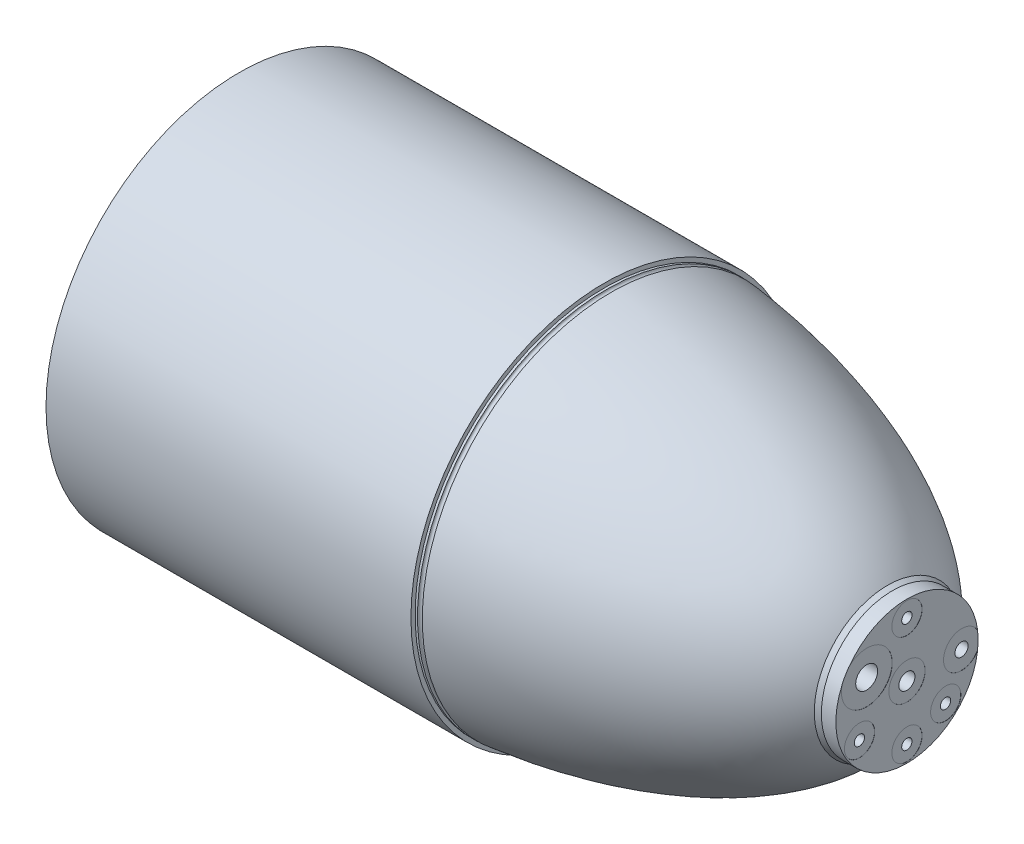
ISO-10303-21;
HEADER;
FILE_DESCRIPTION(('STEP AP214'),'2;1');
FILE_NAME('part.step','',(''),(''),'','','');
FILE_SCHEMA(('AUTOMOTIVE_DESIGN { 1 0 10303 214 1 1 1 1 }'));
ENDSEC;
DATA;
#1=APPLICATION_CONTEXT('core data for automotive mechanical design processes');
#2=APPLICATION_PROTOCOL_DEFINITION('international standard','automotive_design',2000,#1);
#3=PRODUCT_CONTEXT('',#1,'mechanical');
#4=PRODUCT('Part','Part','',(#3));
#5=PRODUCT_RELATED_PRODUCT_CATEGORY('part','',(#4));
#6=PRODUCT_DEFINITION_FORMATION('','',#4);
#7=PRODUCT_DEFINITION_CONTEXT('part definition',#1,'design');
#8=PRODUCT_DEFINITION('design','',#6,#7);
#9=PRODUCT_DEFINITION_SHAPE('','',#8);
#10=(LENGTH_UNIT() NAMED_UNIT(*) SI_UNIT(.MILLI.,.METRE.));
#11=(NAMED_UNIT(*) PLANE_ANGLE_UNIT() SI_UNIT($,.RADIAN.));
#12=(NAMED_UNIT(*) SI_UNIT($,.STERADIAN.) SOLID_ANGLE_UNIT());
#13=UNCERTAINTY_MEASURE_WITH_UNIT(LENGTH_MEASURE(1.E-05),#10,'distance_accuracy_value','');
#14=(GEOMETRIC_REPRESENTATION_CONTEXT(3) GLOBAL_UNCERTAINTY_ASSIGNED_CONTEXT((#13)) GLOBAL_UNIT_ASSIGNED_CONTEXT((#10,
#11,#12)) REPRESENTATION_CONTEXT('',''));
#15=CARTESIAN_POINT('',(0.,0.,0.));
#16=DIRECTION('',(0.,0.,1.));
#17=DIRECTION('',(1.,0.,0.));
#18=AXIS2_PLACEMENT_3D('',#15,#16,#17);
#19=CARTESIAN_POINT('',(299.72,0.,0.));
#20=DIRECTION('',(1.,0.,0.));
#21=DIRECTION('',(0.,0.,-1.));
#22=AXIS2_PLACEMENT_3D('',#19,#20,#21);
#23=CYLINDRICAL_SURFACE('',#22,4.2164);
#24=CARTESIAN_POINT('',(326.394218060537,0.,0.));
#25=DIRECTION('',(1.,0.,0.));
#26=DIRECTION('',(0.,0.,-1.));
#27=AXIS2_PLACEMENT_3D('',#24,#25,#26);
#28=CIRCLE('',#27,4.2164);
#29=CARTESIAN_POINT('',(326.394218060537,0.,-4.2164));
#30=VERTEX_POINT('',#29);
#31=EDGE_CURVE('E164',#30,#30,#28,.T.);
#32=ORIENTED_EDGE('',*,*,#31,.F.);
#33=EDGE_LOOP('',(#32));
#34=FACE_BOUND('',#33,.T.);
#35=CARTESIAN_POINT('',(350.4692,0.,0.));
#36=DIRECTION('',(1.,0.,0.));
#37=DIRECTION('',(0.,0.,-1.));
#38=AXIS2_PLACEMENT_3D('',#35,#36,#37);
#39=CIRCLE('',#38,4.2164);
#40=CARTESIAN_POINT('',(350.4692,0.,-4.2164));
#41=VERTEX_POINT('',#40);
#42=EDGE_CURVE('E168',#41,#41,#39,.F.);
#43=ORIENTED_EDGE('',*,*,#42,.F.);
#44=EDGE_LOOP('',(#43));
#45=FACE_BOUND('',#44,.T.);
#46=ADVANCED_FACE('F30',(#34,#45),#23,.F.);
#47=CARTESIAN_POINT('',(350.52,-37.3425069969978,0.));
#48=DIRECTION('',(-1.,0.,0.));
#49=DIRECTION('',(0.,0.,1.));
#50=AXIS2_PLACEMENT_3D('',#47,#48,#49);
#51=PLANE('',#50);
#52=CARTESIAN_POINT('',(350.52,-14.478,24.892));
#53=DIRECTION('',(1.,0.,0.));
#54=DIRECTION('',(0.,0.,-1.));
#55=AXIS2_PLACEMENT_3D('',#52,#53,#54);
#56=CIRCLE('',#55,7.9375);
#57=CARTESIAN_POINT('',(350.52,-14.478,16.9545));
#58=VERTEX_POINT('',#57);
#59=EDGE_CURVE('E349',#58,#58,#56,.T.);
#60=ORIENTED_EDGE('',*,*,#59,.F.);
#61=EDGE_LOOP('',(#60));
#62=FACE_BOUND('',#61,.T.);
#63=CARTESIAN_POINT('',(350.52,-28.702,0.));
#64=DIRECTION('',(1.,0.,0.));
#65=DIRECTION('',(0.,0.,-1.));
#66=AXIS2_PLACEMENT_3D('',#63,#64,#65);
#67=CIRCLE('',#66,7.9375);
#68=CARTESIAN_POINT('',(350.52,-28.702,-7.9375));
#69=VERTEX_POINT('',#68);
#70=EDGE_CURVE('E337',#69,#69,#67,.T.);
#71=ORIENTED_EDGE('',*,*,#70,.F.);
#72=EDGE_LOOP('',(#71));
#73=FACE_BOUND('',#72,.T.);
#74=CARTESIAN_POINT('',(350.52,-20.32,-20.32));
#75=DIRECTION('',(1.,0.,0.));
#76=DIRECTION('',(0.,0.,-1.));
#77=AXIS2_PLACEMENT_3D('',#74,#75,#76);
#78=CIRCLE('',#77,7.9375);
#79=CARTESIAN_POINT('',(350.52,-20.32,-28.2575));
#80=VERTEX_POINT('',#79);
#81=EDGE_CURVE('E325',#80,#80,#78,.T.);
#82=ORIENTED_EDGE('',*,*,#81,.F.);
#83=EDGE_LOOP('',(#82));
#84=FACE_BOUND('',#83,.T.);
#85=CARTESIAN_POINT('',(350.52,28.702,0.));
#86=DIRECTION('',(1.,0.,0.));
#87=DIRECTION('',(0.,0.,-1.));
#88=AXIS2_PLACEMENT_3D('',#85,#86,#87);
#89=CIRCLE('',#88,7.9375);
#90=CARTESIAN_POINT('',(350.52,28.702,-7.9375));
#91=VERTEX_POINT('',#90);
#92=EDGE_CURVE('E307',#91,#91,#89,.T.);
#93=ORIENTED_EDGE('',*,*,#92,.F.);
#94=EDGE_LOOP('',(#93));
#95=FACE_BOUND('',#94,.T.);
#96=CARTESIAN_POINT('',(350.52,0.,0.));
#97=DIRECTION('',(1.,0.,0.));
#98=DIRECTION('',(0.,0.,-1.));
#99=AXIS2_PLACEMENT_3D('',#96,#97,#98);
#100=CIRCLE('',#99,9.52500000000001);
#101=CARTESIAN_POINT('',(350.52,0.,-9.52500000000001));
#102=VERTEX_POINT('',#101);
#103=EDGE_CURVE('E301',#102,#102,#100,.T.);
#104=ORIENTED_EDGE('',*,*,#103,.F.);
#105=EDGE_LOOP('',(#104));
#106=FACE_BOUND('',#105,.T.);
#107=CARTESIAN_POINT('',(350.52,0.,0.));
#108=DIRECTION('',(1.,0.,0.));
#109=DIRECTION('',(0.,0.,-1.));
#110=AXIS2_PLACEMENT_3D('',#107,#108,#109);
#111=CIRCLE('',#110,37.3425069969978);
#112=CARTESIAN_POINT('',(350.52,15.3697320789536,34.0328395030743));
#113=VERTEX_POINT('',#112);
#114=CARTESIAN_POINT('',(350.52,-4.56353392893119,-37.062609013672));
#115=VERTEX_POINT('',#114);
#116=EDGE_CURVE('E82',#113,#115,#111,.T.);
#117=ORIENTED_EDGE('',*,*,#116,.T.);
#118=CARTESIAN_POINT('',(350.52,0.,-28.702));
#119=DIRECTION('',(1.,0.,0.));
#120=DIRECTION('',(0.,0.,-1.));
#121=AXIS2_PLACEMENT_3D('',#118,#119,#120);
#122=CIRCLE('',#121,9.525);
#123=CARTESIAN_POINT('',(350.52,4.56353392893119,-37.062609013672));
#124=VERTEX_POINT('',#123);
#125=EDGE_CURVE('E71',#124,#115,#122,.T.);
#126=ORIENTED_EDGE('',*,*,#125,.F.);
#127=CARTESIAN_POINT('',(350.52,21.8322031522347,30.2955068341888));
#128=VERTEX_POINT('',#127);
#129=EDGE_CURVE('E79',#124,#128,#111,.T.);
#130=ORIENTED_EDGE('',*,*,#129,.T.);
#131=CARTESIAN_POINT('',(350.52,12.192,21.082));
#132=DIRECTION('',(1.,0.,0.));
#133=DIRECTION('',(0.,0.,-1.));
#134=AXIS2_PLACEMENT_3D('',#131,#132,#133);
#135=CIRCLE('',#134,13.335);
#136=EDGE_CURVE('E92',#113,#128,#135,.T.);
#137=ORIENTED_EDGE('',*,*,#136,.F.);
#138=EDGE_LOOP('',(#117,#126,#130,#137));
#139=FACE_BOUND('',#138,.T.);
#140=ADVANCED_FACE('F32',(#62,#73,#84,#95,#106,#139),#51,.F.);
#141=CARTESIAN_POINT('',(326.394218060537,-42.9270727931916,0.));
#142=DIRECTION('',(1.,0.,0.));
#143=DIRECTION('',(0.,0.,-1.));
#144=AXIS2_PLACEMENT_3D('',#141,#142,#143);
#145=PLANE('',#144);
#146=CARTESIAN_POINT('',(326.394218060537,-14.478,24.892));
#147=DIRECTION('',(1.,0.,0.));
#148=DIRECTION('',(0.,0.,-1.));
#149=AXIS2_PLACEMENT_3D('',#146,#147,#148);
#150=CIRCLE('',#149,2.7051);
#151=CARTESIAN_POINT('',(326.394218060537,-14.478,22.1869));
#152=VERTEX_POINT('',#151);
#153=EDGE_CURVE('E352',#152,#152,#150,.T.);
#154=ORIENTED_EDGE('',*,*,#153,.T.);
#155=EDGE_LOOP('',(#154));
#156=FACE_BOUND('',#155,.T.);
#157=CARTESIAN_POINT('',(326.394218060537,-28.702,0.));
#158=DIRECTION('',(1.,0.,0.));
#159=DIRECTION('',(0.,0.,-1.));
#160=AXIS2_PLACEMENT_3D('',#157,#158,#159);
#161=CIRCLE('',#160,2.7051);
#162=CARTESIAN_POINT('',(326.394218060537,-28.702,-2.7051));
#163=VERTEX_POINT('',#162);
#164=EDGE_CURVE('E340',#163,#163,#161,.T.);
#165=ORIENTED_EDGE('',*,*,#164,.T.);
#166=EDGE_LOOP('',(#165));
#167=FACE_BOUND('',#166,.T.);
#168=CARTESIAN_POINT('',(326.394218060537,-20.32,-20.32));
#169=DIRECTION('',(1.,0.,0.));
#170=DIRECTION('',(0.,0.,-1.));
#171=AXIS2_PLACEMENT_3D('',#168,#169,#170);
#172=CIRCLE('',#171,2.7051);
#173=CARTESIAN_POINT('',(326.394218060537,-20.32,-23.0251));
#174=VERTEX_POINT('',#173);
#175=EDGE_CURVE('E328',#174,#174,#172,.T.);
#176=ORIENTED_EDGE('',*,*,#175,.T.);
#177=EDGE_LOOP('',(#176));
#178=FACE_BOUND('',#177,.T.);
#179=CARTESIAN_POINT('',(326.394218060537,0.,-28.702));
#180=DIRECTION('',(1.,0.,0.));
#181=DIRECTION('',(0.,0.,-1.));
#182=AXIS2_PLACEMENT_3D('',#179,#180,#181);
#183=CIRCLE('',#182,3.4544);
#184=CARTESIAN_POINT('',(326.394218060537,0.,-32.1564));
#185=VERTEX_POINT('',#184);
#186=EDGE_CURVE('E83',#185,#185,#183,.T.);
#187=ORIENTED_EDGE('',*,*,#186,.T.);
#188=EDGE_LOOP('',(#187));
#189=FACE_BOUND('',#188,.T.);
#190=CARTESIAN_POINT('',(326.394218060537,28.702,0.));
#191=DIRECTION('',(1.,0.,0.));
#192=DIRECTION('',(0.,0.,-1.));
#193=AXIS2_PLACEMENT_3D('',#190,#191,#192);
#194=CIRCLE('',#193,2.7051);
#195=CARTESIAN_POINT('',(326.394218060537,28.702,-2.7051));
#196=VERTEX_POINT('',#195);
#197=EDGE_CURVE('E310',#196,#196,#194,.T.);
#198=ORIENTED_EDGE('',*,*,#197,.T.);
#199=EDGE_LOOP('',(#198));
#200=FACE_BOUND('',#199,.T.);
#201=ORIENTED_EDGE('',*,*,#31,.T.);
#202=EDGE_LOOP('',(#201));
#203=FACE_BOUND('',#202,.T.);
#204=CARTESIAN_POINT('',(326.394218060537,12.192,21.082));
#205=DIRECTION('',(1.,0.,0.));
#206=DIRECTION('',(0.,0.,-1.));
#207=AXIS2_PLACEMENT_3D('',#204,#205,#206);
#208=CIRCLE('',#207,5.7531);
#209=CARTESIAN_POINT('',(326.394218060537,12.192,15.3289));
#210=VERTEX_POINT('',#209);
#211=EDGE_CURVE('E294',#210,#210,#208,.T.);
#212=ORIENTED_EDGE('',*,*,#211,.T.);
#213=EDGE_LOOP('',(#212));
#214=FACE_BOUND('',#213,.T.);
#215=CARTESIAN_POINT('',(326.394218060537,0.,0.));
#216=DIRECTION('',(1.,0.,0.));
#217=DIRECTION('',(0.,0.,-1.));
#218=AXIS2_PLACEMENT_3D('',#215,#216,#217);
#219=CIRCLE('',#218,42.9270727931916);
#220=CARTESIAN_POINT('',(326.394218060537,0.,-42.9270727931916));
#221=VERTEX_POINT('',#220);
#222=EDGE_CURVE('E154',#221,#221,#219,.T.);
#223=ORIENTED_EDGE('',*,*,#222,.F.);
#224=EDGE_LOOP('',(#223));
#225=FACE_BOUND('',#224,.T.);
#226=ADVANCED_FACE('F193',(#156,#167,#178,#189,#200,#203,#214,#225),#145,.F.);
#227=CARTESIAN_POINT('',(152.4,0.,0.));
#228=DIRECTION('',(0.,0.,-1.));
#229=DIRECTION('',(1.,0.,0.));
#230=AXIS2_PLACEMENT_3D('',#227,#228,#229);
#231=ELLIPSE('',#230,195.588036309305,93.9838616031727);
#232=TRIMMED_CURVE('',#231,(PARAMETER_VALUE(0.)),(PARAMETER_VALUE(3.14159265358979)),.T.,.PARAMETER.);
#233=CARTESIAN_POINT('',(355.6,0.,0.));
#234=DIRECTION('',(1.,0.,0.));
#235=AXIS1_PLACEMENT('',#233,#234);
#236=SURFACE_OF_REVOLUTION('',#232,#235);
#237=CARTESIAN_POINT('',(214.293552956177,0.,0.));
#238=DIRECTION('',(1.,0.,0.));
#239=DIRECTION('',(0.,0.,-1.));
#240=AXIS2_PLACEMENT_3D('',#237,#238,#239);
#241=CIRCLE('',#240,89.154);
#242=CARTESIAN_POINT('',(214.293552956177,0.,-89.154));
#243=VERTEX_POINT('',#242);
#244=EDGE_CURVE('E151',#243,#243,#241,.T.);
#245=ORIENTED_EDGE('',*,*,#244,.F.);
#246=EDGE_LOOP('',(#245));
#247=FACE_BOUND('',#246,.T.);
#248=ORIENTED_EDGE('',*,*,#222,.T.);
#249=EDGE_LOOP('',(#248));
#250=FACE_BOUND('',#249,.T.);
#251=ADVANCED_FACE('F287',(#247,#250),#236,.T.);
#252=CARTESIAN_POINT('',(355.6,0.,0.));
#253=DIRECTION('',(1.,0.,0.));
#254=DIRECTION('',(0.,0.,-1.));
#255=AXIS2_PLACEMENT_3D('',#252,#253,#254);
#256=CYLINDRICAL_SURFACE('',#255,89.154);
#257=CARTESIAN_POINT('',(187.9854,0.,0.));
#258=DIRECTION('',(1.,0.,0.));
#259=DIRECTION('',(0.,0.,-1.));
#260=AXIS2_PLACEMENT_3D('',#257,#258,#259);
#261=CIRCLE('',#260,89.154);
#262=CARTESIAN_POINT('',(187.9854,0.,-89.154));
#263=VERTEX_POINT('',#262);
#264=EDGE_CURVE('E148',#263,#263,#261,.T.);
#265=ORIENTED_EDGE('',*,*,#264,.F.);
#266=EDGE_LOOP('',(#265));
#267=FACE_BOUND('',#266,.T.);
#268=ORIENTED_EDGE('',*,*,#244,.T.);
#269=EDGE_LOOP('',(#268));
#270=FACE_BOUND('',#269,.T.);
#271=ADVANCED_FACE('F283',(#267,#270),#256,.F.);
#272=CARTESIAN_POINT('',(187.9854,0.,0.));
#273=DIRECTION('',(-1.,0.,0.));
#274=DIRECTION('',(0.,0.,1.));
#275=AXIS2_PLACEMENT_3D('',#272,#273,#274);
#276=CONICAL_SURFACE('',#275,89.154,0.764124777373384);
#277=CARTESIAN_POINT('',(181.8894,0.,0.));
#278=DIRECTION('',(1.,0.,0.));
#279=DIRECTION('',(0.,0.,-1.));
#280=AXIS2_PLACEMENT_3D('',#277,#278,#279);
#281=CIRCLE('',#280,94.996);
#282=CARTESIAN_POINT('',(181.8894,0.,-94.996));
#283=VERTEX_POINT('',#282);
#284=EDGE_CURVE('E145',#283,#283,#281,.T.);
#285=ORIENTED_EDGE('',*,*,#284,.F.);
#286=EDGE_LOOP('',(#285));
#287=FACE_BOUND('',#286,.T.);
#288=ORIENTED_EDGE('',*,*,#264,.T.);
#289=EDGE_LOOP('',(#288));
#290=FACE_BOUND('',#289,.T.);
#291=ADVANCED_FACE('F279',(#287,#290),#276,.F.);
#292=CARTESIAN_POINT('',(355.6,0.,0.));
#293=DIRECTION('',(1.,0.,0.));
#294=DIRECTION('',(0.,0.,-1.));
#295=AXIS2_PLACEMENT_3D('',#292,#293,#294);
#296=CYLINDRICAL_SURFACE('',#295,94.996);
#297=CARTESIAN_POINT('',(44.4754000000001,0.,0.));
#298=DIRECTION('',(1.,0.,0.));
#299=DIRECTION('',(0.,0.,-1.));
#300=AXIS2_PLACEMENT_3D('',#297,#298,#299);
#301=CIRCLE('',#300,94.996);
#302=CARTESIAN_POINT('',(44.4754000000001,0.,-94.996));
#303=VERTEX_POINT('',#302);
#304=EDGE_CURVE('E142',#303,#303,#301,.T.);
#305=ORIENTED_EDGE('',*,*,#304,.F.);
#306=EDGE_LOOP('',(#305));
#307=FACE_BOUND('',#306,.T.);
#308=ORIENTED_EDGE('',*,*,#284,.T.);
#309=EDGE_LOOP('',(#308));
#310=FACE_BOUND('',#309,.T.);
#311=ADVANCED_FACE('F275',(#307,#310),#296,.F.);
#312=CARTESIAN_POINT('',(44.4754,-87.63,0.));
#313=DIRECTION('',(-1.,0.,0.));
#314=DIRECTION('',(0.,0.,1.));
#315=AXIS2_PLACEMENT_3D('',#312,#313,#314);
#316=PLANE('',#315);
#317=CARTESIAN_POINT('',(44.4754,64.6578440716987,-64.6578440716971));
#318=DIRECTION('',(-1.,0.,0.));
#319=DIRECTION('',(0.,0.,1.));
#320=AXIS2_PLACEMENT_3D('',#317,#318,#319);
#321=CIRCLE('',#320,2.15900000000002);
#322=CARTESIAN_POINT('',(44.4754,64.6578440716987,-62.4988440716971));
#323=VERTEX_POINT('',#322);
#324=EDGE_CURVE('E398',#323,#323,#321,.F.);
#325=ORIENTED_EDGE('',*,*,#324,.F.);
#326=EDGE_LOOP('',(#325));
#327=FACE_BOUND('',#326,.T.);
#328=CARTESIAN_POINT('',(44.4754,9.57783715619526E-13,-91.44));
#329=DIRECTION('',(-1.,0.,0.));
#330=DIRECTION('',(0.,0.,1.));
#331=AXIS2_PLACEMENT_3D('',#328,#329,#330);
#332=CIRCLE('',#331,2.159);
#333=CARTESIAN_POINT('',(44.4754,9.57783715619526E-13,-89.281));
#334=VERTEX_POINT('',#333);
#335=EDGE_CURVE('E392',#334,#334,#332,.F.);
#336=ORIENTED_EDGE('',*,*,#335,.F.);
#337=EDGE_LOOP('',(#336));
#338=FACE_BOUND('',#337,.T.);
#339=CARTESIAN_POINT('',(44.4754,-64.6578440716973,-64.6578440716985));
#340=DIRECTION('',(-1.,0.,0.));
#341=DIRECTION('',(0.,0.,1.));
#342=AXIS2_PLACEMENT_3D('',#339,#340,#341);
#343=CIRCLE('',#342,2.159);
#344=CARTESIAN_POINT('',(44.4754,-64.6578440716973,-62.4988440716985));
#345=VERTEX_POINT('',#344);
#346=EDGE_CURVE('E386',#345,#345,#343,.F.);
#347=ORIENTED_EDGE('',*,*,#346,.F.);
#348=EDGE_LOOP('',(#347));
#349=FACE_BOUND('',#348,.T.);
#350=CARTESIAN_POINT('',(44.4754,-91.44,-6.38522477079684E-13));
#351=DIRECTION('',(-1.,0.,0.));
#352=DIRECTION('',(0.,0.,1.));
#353=AXIS2_PLACEMENT_3D('',#350,#351,#352);
#354=CIRCLE('',#353,2.159);
#355=CARTESIAN_POINT('',(44.4754,-91.44,2.15899999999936));
#356=VERTEX_POINT('',#355);
#357=EDGE_CURVE('E380',#356,#356,#354,.F.);
#358=ORIENTED_EDGE('',*,*,#357,.F.);
#359=EDGE_LOOP('',(#358));
#360=FACE_BOUND('',#359,.T.);
#361=CARTESIAN_POINT('',(44.4754,-64.6578440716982,64.6578440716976));
#362=DIRECTION('',(-1.,0.,0.));
#363=DIRECTION('',(0.,0.,1.));
#364=AXIS2_PLACEMENT_3D('',#361,#362,#363);
#365=CIRCLE('',#364,2.159);
#366=CARTESIAN_POINT('',(44.4754,-64.6578440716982,66.8168440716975));
#367=VERTEX_POINT('',#366);
#368=EDGE_CURVE('E374',#367,#367,#365,.F.);
#369=ORIENTED_EDGE('',*,*,#368,.F.);
#370=EDGE_LOOP('',(#369));
#371=FACE_BOUND('',#370,.T.);
#372=CARTESIAN_POINT('',(44.4754,-3.19261238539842E-13,91.44));
#373=DIRECTION('',(-1.,0.,0.));
#374=DIRECTION('',(0.,0.,1.));
#375=AXIS2_PLACEMENT_3D('',#372,#373,#374);
#376=CIRCLE('',#375,2.159);
#377=CARTESIAN_POINT('',(44.4754,-3.19261238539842E-13,93.599));
#378=VERTEX_POINT('',#377);
#379=EDGE_CURVE('E368',#378,#378,#376,.F.);
#380=ORIENTED_EDGE('',*,*,#379,.F.);
#381=EDGE_LOOP('',(#380));
#382=FACE_BOUND('',#381,.T.);
#383=CARTESIAN_POINT('',(44.4754,64.6578440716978,64.657844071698));
#384=DIRECTION('',(-1.,0.,0.));
#385=DIRECTION('',(0.,0.,1.));
#386=AXIS2_PLACEMENT_3D('',#383,#384,#385);
#387=CIRCLE('',#386,2.159);
#388=CARTESIAN_POINT('',(44.4754,64.6578440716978,66.816844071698));
#389=VERTEX_POINT('',#388);
#390=EDGE_CURVE('E362',#389,#389,#387,.F.);
#391=ORIENTED_EDGE('',*,*,#390,.F.);
#392=EDGE_LOOP('',(#391));
#393=FACE_BOUND('',#392,.T.);
#394=CARTESIAN_POINT('',(44.4754,91.44,0.));
#395=DIRECTION('',(-1.,0.,0.));
#396=DIRECTION('',(0.,0.,1.));
#397=AXIS2_PLACEMENT_3D('',#394,#395,#396);
#398=CIRCLE('',#397,2.159);
#399=CARTESIAN_POINT('',(44.4754,91.44,2.159));
#400=VERTEX_POINT('',#399);
#401=EDGE_CURVE('E358',#400,#400,#398,.F.);
#402=ORIENTED_EDGE('',*,*,#401,.F.);
#403=EDGE_LOOP('',(#402));
#404=FACE_BOUND('',#403,.T.);
#405=CARTESIAN_POINT('',(44.4754000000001,0.,0.));
#406=DIRECTION('',(1.,0.,0.));
#407=DIRECTION('',(0.,0.,-1.));
#408=AXIS2_PLACEMENT_3D('',#405,#406,#407);
#409=CIRCLE('',#408,87.63);
#410=CARTESIAN_POINT('',(44.4754000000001,0.,-87.63));
#411=VERTEX_POINT('',#410);
#412=EDGE_CURVE('E139',#411,#411,#409,.T.);
#413=ORIENTED_EDGE('',*,*,#412,.F.);
#414=EDGE_LOOP('',(#413));
#415=FACE_BOUND('',#414,.T.);
#416=ORIENTED_EDGE('',*,*,#304,.T.);
#417=EDGE_LOOP('',(#416));
#418=FACE_BOUND('',#417,.T.);
#419=ADVANCED_FACE('F271',(#327,#338,#349,#360,#371,#382,#393,#404,#415,#418),#316,.F.);
#420=CARTESIAN_POINT('',(355.6,0.,0.));
#421=DIRECTION('',(1.,0.,0.));
#422=DIRECTION('',(0.,0.,-1.));
#423=AXIS2_PLACEMENT_3D('',#420,#421,#422);
#424=CYLINDRICAL_SURFACE('',#423,87.63);
#425=CARTESIAN_POINT('',(38.1254,0.,0.));
#426=DIRECTION('',(1.,0.,0.));
#427=DIRECTION('',(0.,0.,-1.));
#428=AXIS2_PLACEMENT_3D('',#425,#426,#427);
#429=CIRCLE('',#428,87.63);
#430=CARTESIAN_POINT('',(38.1254,0.,-87.63));
#431=VERTEX_POINT('',#430);
#432=EDGE_CURVE('E136',#431,#431,#429,.T.);
#433=ORIENTED_EDGE('',*,*,#432,.F.);
#434=EDGE_LOOP('',(#433));
#435=FACE_BOUND('',#434,.T.);
#436=ORIENTED_EDGE('',*,*,#412,.T.);
#437=EDGE_LOOP('',(#436));
#438=FACE_BOUND('',#437,.T.);
#439=ADVANCED_FACE('F267',(#435,#438),#424,.F.);
#440=CARTESIAN_POINT('',(38.1254,-94.996,0.));
#441=DIRECTION('',(1.,0.,0.));
#442=DIRECTION('',(0.,0.,-1.));
#443=AXIS2_PLACEMENT_3D('',#440,#441,#442);
#444=PLANE('',#443);
#445=CARTESIAN_POINT('',(38.1254,64.6578440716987,-64.6578440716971));
#446=DIRECTION('',(-1.,0.,0.));
#447=DIRECTION('',(0.,0.,1.));
#448=AXIS2_PLACEMENT_3D('',#445,#446,#447);
#449=CIRCLE('',#448,2.15900000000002);
#450=CARTESIAN_POINT('',(38.1254,64.6578440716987,-62.4988440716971));
#451=VERTEX_POINT('',#450);
#452=EDGE_CURVE('E401',#451,#451,#449,.T.);
#453=ORIENTED_EDGE('',*,*,#452,.F.);
#454=EDGE_LOOP('',(#453));
#455=FACE_BOUND('',#454,.T.);
#456=CARTESIAN_POINT('',(38.1254,9.57783715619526E-13,-91.44));
#457=DIRECTION('',(-1.,0.,0.));
#458=DIRECTION('',(0.,0.,1.));
#459=AXIS2_PLACEMENT_3D('',#456,#457,#458);
#460=CIRCLE('',#459,2.159);
#461=CARTESIAN_POINT('',(38.1254,9.57783715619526E-13,-89.281));
#462=VERTEX_POINT('',#461);
#463=EDGE_CURVE('E395',#462,#462,#460,.T.);
#464=ORIENTED_EDGE('',*,*,#463,.F.);
#465=EDGE_LOOP('',(#464));
#466=FACE_BOUND('',#465,.T.);
#467=CARTESIAN_POINT('',(38.1254,-64.6578440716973,-64.6578440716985));
#468=DIRECTION('',(-1.,0.,0.));
#469=DIRECTION('',(0.,0.,1.));
#470=AXIS2_PLACEMENT_3D('',#467,#468,#469);
#471=CIRCLE('',#470,2.159);
#472=CARTESIAN_POINT('',(38.1254,-64.6578440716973,-62.4988440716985));
#473=VERTEX_POINT('',#472);
#474=EDGE_CURVE('E389',#473,#473,#471,.T.);
#475=ORIENTED_EDGE('',*,*,#474,.F.);
#476=EDGE_LOOP('',(#475));
#477=FACE_BOUND('',#476,.T.);
#478=CARTESIAN_POINT('',(38.1254,-91.44,-6.38522477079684E-13));
#479=DIRECTION('',(-1.,0.,0.));
#480=DIRECTION('',(0.,0.,1.));
#481=AXIS2_PLACEMENT_3D('',#478,#479,#480);
#482=CIRCLE('',#481,2.159);
#483=CARTESIAN_POINT('',(38.1254,-91.44,2.15899999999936));
#484=VERTEX_POINT('',#483);
#485=EDGE_CURVE('E383',#484,#484,#482,.T.);
#486=ORIENTED_EDGE('',*,*,#485,.F.);
#487=EDGE_LOOP('',(#486));
#488=FACE_BOUND('',#487,.T.);
#489=CARTESIAN_POINT('',(38.1254,-64.6578440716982,64.6578440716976));
#490=DIRECTION('',(-1.,0.,0.));
#491=DIRECTION('',(0.,0.,1.));
#492=AXIS2_PLACEMENT_3D('',#489,#490,#491);
#493=CIRCLE('',#492,2.159);
#494=CARTESIAN_POINT('',(38.1254,-64.6578440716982,66.8168440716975));
#495=VERTEX_POINT('',#494);
#496=EDGE_CURVE('E377',#495,#495,#493,.T.);
#497=ORIENTED_EDGE('',*,*,#496,.F.);
#498=EDGE_LOOP('',(#497));
#499=FACE_BOUND('',#498,.T.);
#500=CARTESIAN_POINT('',(38.1254,-3.19261238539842E-13,91.44));
#501=DIRECTION('',(-1.,0.,0.));
#502=DIRECTION('',(0.,0.,1.));
#503=AXIS2_PLACEMENT_3D('',#500,#501,#502);
#504=CIRCLE('',#503,2.159);
#505=CARTESIAN_POINT('',(38.1254,-3.19261238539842E-13,93.599));
#506=VERTEX_POINT('',#505);
#507=EDGE_CURVE('E371',#506,#506,#504,.T.);
#508=ORIENTED_EDGE('',*,*,#507,.F.);
#509=EDGE_LOOP('',(#508));
#510=FACE_BOUND('',#509,.T.);
#511=CARTESIAN_POINT('',(38.1254,64.6578440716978,64.657844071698));
#512=DIRECTION('',(-1.,0.,0.));
#513=DIRECTION('',(0.,0.,1.));
#514=AXIS2_PLACEMENT_3D('',#511,#512,#513);
#515=CIRCLE('',#514,2.159);
#516=CARTESIAN_POINT('',(38.1254,64.6578440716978,66.816844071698));
#517=VERTEX_POINT('',#516);
#518=EDGE_CURVE('E365',#517,#517,#515,.T.);
#519=ORIENTED_EDGE('',*,*,#518,.F.);
#520=EDGE_LOOP('',(#519));
#521=FACE_BOUND('',#520,.T.);
#522=CARTESIAN_POINT('',(38.1254,91.44,0.));
#523=DIRECTION('',(-1.,0.,0.));
#524=DIRECTION('',(0.,0.,1.));
#525=AXIS2_PLACEMENT_3D('',#522,#523,#524);
#526=CIRCLE('',#525,2.159);
#527=CARTESIAN_POINT('',(38.1254,91.44,2.159));
#528=VERTEX_POINT('',#527);
#529=EDGE_CURVE('E359',#528,#528,#526,.T.);
#530=ORIENTED_EDGE('',*,*,#529,.F.);
#531=EDGE_LOOP('',(#530));
#532=FACE_BOUND('',#531,.T.);
#533=CARTESIAN_POINT('',(38.1254,0.,0.));
#534=DIRECTION('',(1.,0.,0.));
#535=DIRECTION('',(0.,0.,-1.));
#536=AXIS2_PLACEMENT_3D('',#533,#534,#535);
#537=CIRCLE('',#536,94.996);
#538=CARTESIAN_POINT('',(38.1254,0.,-94.996));
#539=VERTEX_POINT('',#538);
#540=EDGE_CURVE('E133',#539,#539,#537,.T.);
#541=ORIENTED_EDGE('',*,*,#540,.F.);
#542=EDGE_LOOP('',(#541));
#543=FACE_BOUND('',#542,.T.);
#544=ORIENTED_EDGE('',*,*,#432,.T.);
#545=EDGE_LOOP('',(#544));
#546=FACE_BOUND('',#545,.T.);
#547=ADVANCED_FACE('F263',(#455,#466,#477,#488,#499,#510,#521,#532,#543,#546),#444,.F.);
#548=CARTESIAN_POINT('',(355.6,0.,0.));
#549=DIRECTION('',(1.,0.,0.));
#550=DIRECTION('',(0.,0.,-1.));
#551=AXIS2_PLACEMENT_3D('',#548,#549,#550);
#552=CYLINDRICAL_SURFACE('',#551,94.996);
#553=CARTESIAN_POINT('',(28.4734,0.,0.));
#554=DIRECTION('',(1.,0.,0.));
#555=DIRECTION('',(0.,0.,-1.));
#556=AXIS2_PLACEMENT_3D('',#553,#554,#555);
#557=CIRCLE('',#556,94.996);
#558=CARTESIAN_POINT('',(28.4734,0.,-94.996));
#559=VERTEX_POINT('',#558);
#560=EDGE_CURVE('E130',#559,#559,#557,.T.);
#561=ORIENTED_EDGE('',*,*,#560,.F.);
#562=EDGE_LOOP('',(#561));
#563=FACE_BOUND('',#562,.T.);
#564=ORIENTED_EDGE('',*,*,#540,.T.);
#565=EDGE_LOOP('',(#564));
#566=FACE_BOUND('',#565,.T.);
#567=ADVANCED_FACE('F259',(#563,#566),#552,.F.);
#568=CARTESIAN_POINT('',(28.4734,0.,0.));
#569=DIRECTION('',(-1.,0.,0.));
#570=DIRECTION('',(0.,0.,1.));
#571=AXIS2_PLACEMENT_3D('',#568,#569,#570);
#572=CONICAL_SURFACE('',#571,94.996,0.206992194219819);
#573=CARTESIAN_POINT('',(25.9334,0.,0.));
#574=DIRECTION('',(1.,0.,0.));
#575=DIRECTION('',(0.,0.,-1.));
#576=AXIS2_PLACEMENT_3D('',#573,#574,#575);
#577=CIRCLE('',#576,95.5294);
#578=CARTESIAN_POINT('',(25.9334,0.,-95.5294));
#579=VERTEX_POINT('',#578);
#580=EDGE_CURVE('E127',#579,#579,#577,.T.);
#581=ORIENTED_EDGE('',*,*,#580,.F.);
#582=EDGE_LOOP('',(#581));
#583=FACE_BOUND('',#582,.T.);
#584=ORIENTED_EDGE('',*,*,#560,.T.);
#585=EDGE_LOOP('',(#584));
#586=FACE_BOUND('',#585,.T.);
#587=ADVANCED_FACE('F255',(#583,#586),#572,.F.);
#588=CARTESIAN_POINT('',(355.6,0.,0.));
#589=DIRECTION('',(1.,0.,0.));
#590=DIRECTION('',(0.,0.,-1.));
#591=AXIS2_PLACEMENT_3D('',#588,#589,#590);
#592=CYLINDRICAL_SURFACE('',#591,95.5294);
#593=CARTESIAN_POINT('',(5.334,0.,0.));
#594=DIRECTION('',(1.,0.,0.));
#595=DIRECTION('',(0.,0.,-1.));
#596=AXIS2_PLACEMENT_3D('',#593,#594,#595);
#597=CIRCLE('',#596,95.5294);
#598=CARTESIAN_POINT('',(5.334,0.,-95.5294));
#599=VERTEX_POINT('',#598);
#600=EDGE_CURVE('E124',#599,#599,#597,.T.);
#601=ORIENTED_EDGE('',*,*,#600,.F.);
#602=EDGE_LOOP('',(#601));
#603=FACE_BOUND('',#602,.T.);
#604=ORIENTED_EDGE('',*,*,#580,.T.);
#605=EDGE_LOOP('',(#604));
#606=FACE_BOUND('',#605,.T.);
#607=ADVANCED_FACE('F251',(#603,#606),#592,.F.);
#608=CARTESIAN_POINT('',(3.68299999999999,0.,0.));
#609=DIRECTION('',(1.,0.,0.));
#610=DIRECTION('',(0.,0.,-1.));
#611=AXIS2_PLACEMENT_3D('',#608,#609,#610);
#612=TOROIDAL_SURFACE('',#611,95.5294,1.651);
#613=CARTESIAN_POINT('',(2.03200000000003,0.,0.));
#614=DIRECTION('',(1.,0.,0.));
#615=DIRECTION('',(0.,0.,-1.));
#616=AXIS2_PLACEMENT_3D('',#613,#614,#615);
#617=CIRCLE('',#616,95.5294);
#618=CARTESIAN_POINT('',(2.03200000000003,0.,-95.5294));
#619=VERTEX_POINT('',#618);
#620=EDGE_CURVE('E121',#619,#619,#617,.T.);
#621=ORIENTED_EDGE('',*,*,#620,.F.);
#622=EDGE_LOOP('',(#621));
#623=FACE_BOUND('',#622,.T.);
#624=ORIENTED_EDGE('',*,*,#600,.T.);
#625=EDGE_LOOP('',(#624));
#626=FACE_BOUND('',#625,.T.);
#627=ADVANCED_FACE('F247',(#623,#626),#612,.F.);
#628=CARTESIAN_POINT('',(355.6,0.,0.));
#629=DIRECTION('',(1.,0.,0.));
#630=DIRECTION('',(0.,0.,-1.));
#631=AXIS2_PLACEMENT_3D('',#628,#629,#630);
#632=CYLINDRICAL_SURFACE('',#631,95.5294);
#633=CARTESIAN_POINT('',(0.,0.,0.));
#634=DIRECTION('',(1.,0.,0.));
#635=DIRECTION('',(0.,0.,-1.));
#636=AXIS2_PLACEMENT_3D('',#633,#634,#635);
#637=CIRCLE('',#636,95.5294);
#638=CARTESIAN_POINT('',(0.,0.,-95.5294));
#639=VERTEX_POINT('',#638);
#640=EDGE_CURVE('E118',#639,#639,#637,.T.);
#641=ORIENTED_EDGE('',*,*,#640,.F.);
#642=EDGE_LOOP('',(#641));
#643=FACE_BOUND('',#642,.T.);
#644=ORIENTED_EDGE('',*,*,#620,.T.);
#645=EDGE_LOOP('',(#644));
#646=FACE_BOUND('',#645,.T.);
#647=ADVANCED_FACE('F243',(#643,#646),#632,.F.);
#648=CARTESIAN_POINT('',(0.,-101.346,0.));
#649=DIRECTION('',(1.,0.,0.));
#650=DIRECTION('',(0.,0.,-1.));
#651=AXIS2_PLACEMENT_3D('',#648,#649,#650);
#652=PLANE('',#651);
#653=CARTESIAN_POINT('',(0.,0.,0.));
#654=DIRECTION('',(1.,0.,0.));
#655=DIRECTION('',(0.,0.,-1.));
#656=AXIS2_PLACEMENT_3D('',#653,#654,#655);
#657=CIRCLE('',#656,101.346);
#658=CARTESIAN_POINT('',(0.,0.,-101.346));
#659=VERTEX_POINT('',#658);
#660=EDGE_CURVE('E115',#659,#659,#657,.T.);
#661=ORIENTED_EDGE('',*,*,#660,.F.);
#662=EDGE_LOOP('',(#661));
#663=FACE_BOUND('',#662,.T.);
#664=ORIENTED_EDGE('',*,*,#640,.T.);
#665=EDGE_LOOP('',(#664));
#666=FACE_BOUND('',#665,.T.);
#667=ADVANCED_FACE('F239',(#663,#666),#652,.F.);
#668=CARTESIAN_POINT('',(355.6,0.,0.));
#669=DIRECTION('',(1.,0.,0.));
#670=DIRECTION('',(0.,0.,-1.));
#671=AXIS2_PLACEMENT_3D('',#668,#669,#670);
#672=CYLINDRICAL_SURFACE('',#671,101.346);
#673=CARTESIAN_POINT('',(191.516,0.,0.));
#674=DIRECTION('',(1.,0.,0.));
#675=DIRECTION('',(0.,0.,-1.));
#676=AXIS2_PLACEMENT_3D('',#673,#674,#675);
#677=CIRCLE('',#676,101.346);
#678=CARTESIAN_POINT('',(191.516,0.,-101.346));
#679=VERTEX_POINT('',#678);
#680=EDGE_CURVE('E112',#679,#679,#677,.T.);
#681=ORIENTED_EDGE('',*,*,#680,.F.);
#682=EDGE_LOOP('',(#681));
#683=FACE_BOUND('',#682,.T.);
#684=ORIENTED_EDGE('',*,*,#660,.T.);
#685=EDGE_LOOP('',(#684));
#686=FACE_BOUND('',#685,.T.);
#687=ADVANCED_FACE('F235',(#683,#686),#672,.T.);
#688=CARTESIAN_POINT('',(191.516,-101.346,0.));
#689=DIRECTION('',(-1.,0.,0.));
#690=DIRECTION('',(0.,0.,1.));
#691=AXIS2_PLACEMENT_3D('',#688,#689,#690);
#692=PLANE('',#691);
#693=CARTESIAN_POINT('',(191.516,0.,0.));
#694=DIRECTION('',(1.,0.,0.));
#695=DIRECTION('',(0.,0.,-1.));
#696=AXIS2_PLACEMENT_3D('',#693,#694,#695);
#697=CIRCLE('',#696,99.1470026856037);
#698=CARTESIAN_POINT('',(191.516,0.,-99.1470026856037));
#699=VERTEX_POINT('',#698);
#700=EDGE_CURVE('E109',#699,#699,#697,.T.);
#701=ORIENTED_EDGE('',*,*,#700,.F.);
#702=EDGE_LOOP('',(#701));
#703=FACE_BOUND('',#702,.T.);
#704=ORIENTED_EDGE('',*,*,#680,.T.);
#705=EDGE_LOOP('',(#704));
#706=FACE_BOUND('',#705,.T.);
#707=ADVANCED_FACE('F231',(#703,#706),#692,.F.);
#708=CARTESIAN_POINT('',(355.6,0.,0.));
#709=DIRECTION('',(1.,0.,0.));
#710=DIRECTION('',(0.,0.,-1.));
#711=AXIS2_PLACEMENT_3D('',#708,#709,#710);
#712=CYLINDRICAL_SURFACE('',#711,99.1470026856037);
#713=CARTESIAN_POINT('',(192.786,0.,0.));
#714=DIRECTION('',(1.,0.,0.));
#715=DIRECTION('',(0.,0.,-1.));
#716=AXIS2_PLACEMENT_3D('',#713,#714,#715);
#717=CIRCLE('',#716,99.1470026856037);
#718=CARTESIAN_POINT('',(192.786,0.,-99.1470026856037));
#719=VERTEX_POINT('',#718);
#720=EDGE_CURVE('E106',#719,#719,#717,.T.);
#721=ORIENTED_EDGE('',*,*,#720,.F.);
#722=EDGE_LOOP('',(#721));
#723=FACE_BOUND('',#722,.T.);
#724=ORIENTED_EDGE('',*,*,#700,.T.);
#725=EDGE_LOOP('',(#724));
#726=FACE_BOUND('',#725,.T.);
#727=ADVANCED_FACE('F227',(#723,#726),#712,.T.);
#728=CARTESIAN_POINT('',(193.99482956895,0.,0.));
#729=DIRECTION('',(1.,0.,0.));
#730=DIRECTION('',(0.,0.,-1.));
#731=AXIS2_PLACEMENT_3D('',#728,#729,#730);
#732=TOROIDAL_SURFACE('',#731,99.1095002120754,1.2094111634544);
#733=CARTESIAN_POINT('',(195.2036591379,0.,0.));
#734=DIRECTION('',(1.,0.,0.));
#735=DIRECTION('',(0.,0.,-1.));
#736=AXIS2_PLACEMENT_3D('',#733,#734,#735);
#737=CIRCLE('',#736,99.0719977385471);
#738=CARTESIAN_POINT('',(195.2036591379,0.,-99.0719977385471));
#739=VERTEX_POINT('',#738);
#740=EDGE_CURVE('E103',#739,#739,#737,.T.);
#741=ORIENTED_EDGE('',*,*,#740,.F.);
#742=EDGE_LOOP('',(#741));
#743=FACE_BOUND('',#742,.T.);
#744=ORIENTED_EDGE('',*,*,#720,.T.);
#745=EDGE_LOOP('',(#744));
#746=FACE_BOUND('',#745,.T.);
#747=ADVANCED_FACE('F223',(#743,#746),#732,.F.);
#748=CARTESIAN_POINT('',(152.4,0.,0.));
#749=DIRECTION('',(0.,0.,1.));
#750=DIRECTION('',(1.,0.,0.));
#751=AXIS2_PLACEMENT_3D('',#748,#749,#750);
#752=ELLIPSE('',#751,203.2,101.346);
#753=TRIMMED_CURVE('',#752,(PARAMETER_VALUE(3.14159265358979)),
(PARAMETER_VALUE(6.28318530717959)),.T.,.PARAMETER.);
#754=CARTESIAN_POINT('',(355.6,0.,0.));
#755=DIRECTION('',(1.,0.,0.));
#756=AXIS1_PLACEMENT('',#754,#755);
#757=SURFACE_OF_REVOLUTION('',#753,#756);
#758=CARTESIAN_POINT('',(340.36,0.,0.));
#759=DIRECTION('',(1.,0.,0.));
#760=DIRECTION('',(0.,0.,-1.));
#761=AXIS2_PLACEMENT_3D('',#758,#759,#760);
#762=CIRCLE('',#761,38.5081461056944);
#763=CARTESIAN_POINT('',(340.36,0.,-38.5081461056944));
#764=VERTEX_POINT('',#763);
#765=EDGE_CURVE('E100',#764,#764,#762,.T.);
#766=ORIENTED_EDGE('',*,*,#765,.F.);
#767=EDGE_LOOP('',(#766));
#768=FACE_BOUND('',#767,.T.);
#769=ORIENTED_EDGE('',*,*,#740,.T.);
#770=EDGE_LOOP('',(#769));
#771=FACE_BOUND('',#770,.T.);
#772=ADVANCED_FACE('F219',(#768,#771),#757,.T.);
#773=CARTESIAN_POINT('',(340.36,0.,0.));
#774=DIRECTION('',(-1.,0.,0.));
#775=DIRECTION('',(0.,0.,1.));
#776=AXIS2_PLACEMENT_3D('',#773,#774,#775);
#777=CONICAL_SURFACE('',#776,38.5081461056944,0.430241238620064);
#778=CARTESIAN_POINT('',(342.9,0.,0.));
#779=DIRECTION('',(1.,0.,0.));
#780=DIRECTION('',(0.,0.,-1.));
#781=AXIS2_PLACEMENT_3D('',#778,#779,#780);
#782=CIRCLE('',#781,37.3425069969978);
#783=CARTESIAN_POINT('',(342.9,0.,-37.3425069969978));
#784=VERTEX_POINT('',#783);
#785=EDGE_CURVE('E91',#784,#784,#782,.T.);
#786=ORIENTED_EDGE('',*,*,#785,.F.);
#787=EDGE_LOOP('',(#786));
#788=FACE_BOUND('',#787,.T.);
#789=ORIENTED_EDGE('',*,*,#765,.T.);
#790=EDGE_LOOP('',(#789));
#791=FACE_BOUND('',#790,.T.);
#792=ADVANCED_FACE('F216',(#788,#791),#777,.T.);
#793=CARTESIAN_POINT('',(355.6,0.,0.));
#794=DIRECTION('',(1.,0.,0.));
#795=DIRECTION('',(0.,0.,-1.));
#796=AXIS2_PLACEMENT_3D('',#793,#794,#795);
#797=CYLINDRICAL_SURFACE('',#796,37.3425069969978);
#798=ORIENTED_EDGE('',*,*,#129,.F.);
#799=DIRECTION('',(1.,0.,0.));
#800=VECTOR('',#799,1.);
#801=CARTESIAN_POINT('',(350.4819,4.56353392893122,-37.062609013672));
#802=LINE('',#801,#800);
#803=CARTESIAN_POINT('',(350.4438,4.56353392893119,-37.062609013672));
#804=VERTEX_POINT('',#803);
#805=EDGE_CURVE('E11',#124,#804,#802,.F.);
#806=ORIENTED_EDGE('',*,*,#805,.T.);
#807=CARTESIAN_POINT('',(350.4438,0.,0.));
#808=DIRECTION('',(1.,0.,0.));
#809=DIRECTION('',(0.,0.,-1.));
#810=AXIS2_PLACEMENT_3D('',#807,#808,#809);
#811=CIRCLE('',#810,37.3425069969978);
#812=CARTESIAN_POINT('',(350.4438,-4.56353392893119,-37.062609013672));
#813=VERTEX_POINT('',#812);
#814=EDGE_CURVE('E163',#813,#804,#811,.T.);
#815=ORIENTED_EDGE('',*,*,#814,.F.);
#816=DIRECTION('',(1.,0.,0.));
#817=VECTOR('',#816,1.);
#818=CARTESIAN_POINT('',(350.4819,-4.56353392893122,-37.062609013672));
#819=LINE('',#818,#817);
#820=EDGE_CURVE('E38',#813,#115,#819,.T.);
#821=ORIENTED_EDGE('',*,*,#820,.T.);
#822=ORIENTED_EDGE('',*,*,#116,.F.);
#823=DIRECTION('',(1.,0.,0.));
#824=VECTOR('',#823,1.);
#825=CARTESIAN_POINT('',(350.4819,15.3697320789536,34.0328395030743));
#826=LINE('',#825,#824);
#827=CARTESIAN_POINT('',(350.4438,15.3697320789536,34.0328395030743));
#828=VERTEX_POINT('',#827);
#829=EDGE_CURVE('E160',#113,#828,#826,.F.);
#830=ORIENTED_EDGE('',*,*,#829,.T.);
#831=CARTESIAN_POINT('',(350.4438,0.,0.));
#832=DIRECTION('',(1.,0.,0.));
#833=DIRECTION('',(0.,0.,-1.));
#834=AXIS2_PLACEMENT_3D('',#831,#832,#833);
#835=CIRCLE('',#834,37.3425069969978);
#836=CARTESIAN_POINT('',(350.4438,21.8322031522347,30.2955068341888));
#837=VERTEX_POINT('',#836);
#838=EDGE_CURVE('E157',#837,#828,#835,.T.);
#839=ORIENTED_EDGE('',*,*,#838,.F.);
#840=DIRECTION('',(1.,0.,0.));
#841=VECTOR('',#840,1.);
#842=CARTESIAN_POINT('',(350.4819,21.8322031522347,30.2955068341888));
#843=LINE('',#842,#841);
#844=EDGE_CURVE('E89',#837,#128,#843,.T.);
#845=ORIENTED_EDGE('',*,*,#844,.T.);
#846=EDGE_LOOP('',(#798,#806,#815,#821,#822,#830,#839,#845));
#847=FACE_BOUND('',#846,.T.);
#848=ORIENTED_EDGE('',*,*,#785,.T.);
#849=EDGE_LOOP('',(#848));
#850=FACE_BOUND('',#849,.T.);
#851=ADVANCED_FACE('F86',(#847,#850),#797,.T.);
#852=CARTESIAN_POINT('',(350.4438,12.192,21.082));
#853=DIRECTION('',(1.,0.,0.));
#854=DIRECTION('',(0.,0.,-1.));
#855=AXIS2_PLACEMENT_3D('',#852,#853,#854);
#856=CYLINDRICAL_SURFACE('',#855,13.335);
#857=ORIENTED_EDGE('',*,*,#136,.T.);
#858=ORIENTED_EDGE('',*,*,#844,.F.);
#859=CARTESIAN_POINT('',(350.4438,12.192,21.082));
#860=DIRECTION('',(1.,0.,0.));
#861=DIRECTION('',(0.,0.,-1.));
#862=AXIS2_PLACEMENT_3D('',#859,#860,#861);
#863=CIRCLE('',#862,13.335);
#864=EDGE_CURVE('E51',#828,#837,#863,.T.);
#865=ORIENTED_EDGE('',*,*,#864,.F.);
#866=ORIENTED_EDGE('',*,*,#829,.F.);
#867=EDGE_LOOP('',(#857,#858,#865,#866));
#868=FACE_BOUND('',#867,.T.);
#869=ADVANCED_FACE('F209',(#868),#856,.F.);
#870=CARTESIAN_POINT('',(350.4438,12.192,21.082));
#871=DIRECTION('',(1.,0.,0.));
#872=DIRECTION('',(0.,0.,-1.));
#873=AXIS2_PLACEMENT_3D('',#870,#871,#872);
#874=PLANE('',#873);
#875=CARTESIAN_POINT('',(350.4438,12.192,21.082));
#876=DIRECTION('',(1.,0.,0.));
#877=DIRECTION('',(0.,0.,-1.));
#878=AXIS2_PLACEMENT_3D('',#875,#876,#877);
#879=CIRCLE('',#878,5.7531);
#880=CARTESIAN_POINT('',(350.4438,12.192,15.3289));
#881=VERTEX_POINT('',#880);
#882=EDGE_CURVE('E167',#881,#881,#879,.T.);
#883=ORIENTED_EDGE('',*,*,#882,.F.);
#884=EDGE_LOOP('',(#883));
#885=FACE_BOUND('',#884,.T.);
#886=ORIENTED_EDGE('',*,*,#838,.T.);
#887=ORIENTED_EDGE('',*,*,#864,.T.);
#888=EDGE_LOOP('',(#886,#887));
#889=FACE_BOUND('',#888,.T.);
#890=ADVANCED_FACE('F205',(#885,#889),#874,.T.);
#891=CARTESIAN_POINT('',(325.0438,12.192,21.082));
#892=DIRECTION('',(1.,0.,0.));
#893=DIRECTION('',(0.,0.,-1.));
#894=AXIS2_PLACEMENT_3D('',#891,#892,#893);
#895=CYLINDRICAL_SURFACE('',#894,5.7531);
#896=ORIENTED_EDGE('',*,*,#882,.T.);
#897=EDGE_LOOP('',(#896));
#898=FACE_BOUND('',#897,.T.);
#899=ORIENTED_EDGE('',*,*,#211,.F.);
#900=EDGE_LOOP('',(#899));
#901=FACE_BOUND('',#900,.T.);
#902=ADVANCED_FACE('F201',(#898,#901),#895,.F.);
#903=CARTESIAN_POINT('',(350.4692,0.,0.));
#904=DIRECTION('',(1.,0.,0.));
#905=DIRECTION('',(0.,0.,-1.));
#906=AXIS2_PLACEMENT_3D('',#903,#904,#905);
#907=PLANE('',#906);
#908=CARTESIAN_POINT('',(350.4692,0.,0.));
#909=DIRECTION('',(1.,0.,0.));
#910=DIRECTION('',(0.,0.,-1.));
#911=AXIS2_PLACEMENT_3D('',#908,#909,#910);
#912=CIRCLE('',#911,9.52500000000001);
#913=CARTESIAN_POINT('',(350.4692,0.,-9.52500000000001));
#914=VERTEX_POINT('',#913);
#915=EDGE_CURVE('E171',#914,#914,#912,.T.);
#916=ORIENTED_EDGE('',*,*,#915,.T.);
#917=EDGE_LOOP('',(#916));
#918=FACE_BOUND('',#917,.T.);
#919=ORIENTED_EDGE('',*,*,#42,.T.);
#920=EDGE_LOOP('',(#919));
#921=FACE_BOUND('',#920,.T.);
#922=ADVANCED_FACE('F204',(#918,#921),#907,.T.);
#923=CARTESIAN_POINT('',(350.4692,0.,0.));
#924=DIRECTION('',(1.,0.,0.));
#925=DIRECTION('',(0.,0.,-1.));
#926=AXIS2_PLACEMENT_3D('',#923,#924,#925);
#927=CYLINDRICAL_SURFACE('',#926,9.52500000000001);
#928=ORIENTED_EDGE('',*,*,#915,.F.);
#929=EDGE_LOOP('',(#928));
#930=FACE_BOUND('',#929,.T.);
#931=ORIENTED_EDGE('',*,*,#103,.T.);
#932=EDGE_LOOP('',(#931));
#933=FACE_BOUND('',#932,.T.);
#934=ADVANCED_FACE('F199',(#930,#933),#927,.F.);
#935=CARTESIAN_POINT('',(350.4438,28.702,0.));
#936=DIRECTION('',(1.,0.,0.));
#937=DIRECTION('',(0.,0.,-1.));
#938=AXIS2_PLACEMENT_3D('',#935,#936,#937);
#939=CYLINDRICAL_SURFACE('',#938,7.9375);
#940=CARTESIAN_POINT('',(350.4438,28.702,0.));
#941=DIRECTION('',(1.,0.,0.));
#942=DIRECTION('',(0.,0.,-1.));
#943=AXIS2_PLACEMENT_3D('',#940,#941,#942);
#944=CIRCLE('',#943,7.9375);
#945=CARTESIAN_POINT('',(350.4438,28.702,-7.9375));
#946=VERTEX_POINT('',#945);
#947=EDGE_CURVE('E304',#946,#946,#944,.T.);
#948=ORIENTED_EDGE('',*,*,#947,.F.);
#949=EDGE_LOOP('',(#948));
#950=FACE_BOUND('',#949,.T.);
#951=ORIENTED_EDGE('',*,*,#92,.T.);
#952=EDGE_LOOP('',(#951));
#953=FACE_BOUND('',#952,.T.);
#954=ADVANCED_FACE('F460',(#950,#953),#939,.F.);
#955=CARTESIAN_POINT('',(350.4438,28.702,0.));
#956=DIRECTION('',(1.,0.,0.));
#957=DIRECTION('',(0.,0.,-1.));
#958=AXIS2_PLACEMENT_3D('',#955,#956,#957);
#959=PLANE('',#958);
#960=CARTESIAN_POINT('',(350.4438,28.702,0.));
#961=DIRECTION('',(1.,0.,0.));
#962=DIRECTION('',(0.,0.,-1.));
#963=AXIS2_PLACEMENT_3D('',#960,#961,#962);
#964=CIRCLE('',#963,2.7051);
#965=CARTESIAN_POINT('',(350.4438,28.702,-2.7051));
#966=VERTEX_POINT('',#965);
#967=EDGE_CURVE('E313',#966,#966,#964,.T.);
#968=ORIENTED_EDGE('',*,*,#967,.F.);
#969=EDGE_LOOP('',(#968));
#970=FACE_BOUND('',#969,.T.);
#971=ORIENTED_EDGE('',*,*,#947,.T.);
#972=EDGE_LOOP('',(#971));
#973=FACE_BOUND('',#972,.T.);
#974=ADVANCED_FACE('F454',(#970,#973),#959,.T.);
#975=CARTESIAN_POINT('',(299.6438,28.702,0.));
#976=DIRECTION('',(1.,0.,0.));
#977=DIRECTION('',(0.,0.,-1.));
#978=AXIS2_PLACEMENT_3D('',#975,#976,#977);
#979=CYLINDRICAL_SURFACE('',#978,2.7051);
#980=ORIENTED_EDGE('',*,*,#967,.T.);
#981=EDGE_LOOP('',(#980));
#982=FACE_BOUND('',#981,.T.);
#983=ORIENTED_EDGE('',*,*,#197,.F.);
#984=EDGE_LOOP('',(#983));
#985=FACE_BOUND('',#984,.T.);
#986=ADVANCED_FACE('F184',(#982,#985),#979,.F.);
#987=CARTESIAN_POINT('',(350.4438,0.,-28.702));
#988=DIRECTION('',(1.,0.,0.));
#989=DIRECTION('',(0.,0.,-1.));
#990=AXIS2_PLACEMENT_3D('',#987,#988,#989);
#991=CYLINDRICAL_SURFACE('',#990,9.525);
#992=ORIENTED_EDGE('',*,*,#125,.T.);
#993=ORIENTED_EDGE('',*,*,#820,.F.);
#994=CARTESIAN_POINT('',(350.4438,0.,-28.702));
#995=DIRECTION('',(1.,0.,0.));
#996=DIRECTION('',(0.,0.,-1.));
#997=AXIS2_PLACEMENT_3D('',#994,#995,#996);
#998=CIRCLE('',#997,9.525);
#999=EDGE_CURVE('E44',#804,#813,#998,.T.);
#1000=ORIENTED_EDGE('',*,*,#999,.F.);
#1001=ORIENTED_EDGE('',*,*,#805,.F.);
#1002=EDGE_LOOP('',(#992,#993,#1000,#1001));
#1003=FACE_BOUND('',#1002,.T.);
#1004=ADVANCED_FACE('F70',(#1003),#991,.F.);
#1005=CARTESIAN_POINT('',(350.4438,0.,-28.702));
#1006=DIRECTION('',(1.,0.,0.));
#1007=DIRECTION('',(0.,0.,-1.));
#1008=AXIS2_PLACEMENT_3D('',#1005,#1006,#1007);
#1009=PLANE('',#1008);
#1010=CARTESIAN_POINT('',(350.4438,0.,-28.702));
#1011=DIRECTION('',(1.,0.,0.));
#1012=DIRECTION('',(0.,0.,-1.));
#1013=AXIS2_PLACEMENT_3D('',#1010,#1011,#1012);
#1014=CIRCLE('',#1013,3.4544);
#1015=CARTESIAN_POINT('',(350.4438,0.,-32.1564));
#1016=VERTEX_POINT('',#1015);
#1017=EDGE_CURVE('E319',#1016,#1016,#1014,.T.);
#1018=ORIENTED_EDGE('',*,*,#1017,.F.);
#1019=EDGE_LOOP('',(#1018));
#1020=FACE_BOUND('',#1019,.T.);
#1021=ORIENTED_EDGE('',*,*,#814,.T.);
#1022=ORIENTED_EDGE('',*,*,#999,.T.);
#1023=EDGE_LOOP('',(#1021,#1022));
#1024=FACE_BOUND('',#1023,.T.);
#1025=ADVANCED_FACE('F172',(#1020,#1024),#1009,.T.);
#1026=CARTESIAN_POINT('',(299.6438,0.,-28.702));
#1027=DIRECTION('',(1.,0.,0.));
#1028=DIRECTION('',(0.,0.,-1.));
#1029=AXIS2_PLACEMENT_3D('',#1026,#1027,#1028);
#1030=CYLINDRICAL_SURFACE('',#1029,3.4544);
#1031=ORIENTED_EDGE('',*,*,#1017,.T.);
#1032=EDGE_LOOP('',(#1031));
#1033=FACE_BOUND('',#1032,.T.);
#1034=ORIENTED_EDGE('',*,*,#186,.F.);
#1035=EDGE_LOOP('',(#1034));
#1036=FACE_BOUND('',#1035,.T.);
#1037=ADVANCED_FACE('F174',(#1033,#1036),#1030,.F.);
#1038=CARTESIAN_POINT('',(350.4438,-20.32,-20.32));
#1039=DIRECTION('',(1.,0.,0.));
#1040=DIRECTION('',(0.,0.,-1.));
#1041=AXIS2_PLACEMENT_3D('',#1038,#1039,#1040);
#1042=CYLINDRICAL_SURFACE('',#1041,7.9375);
#1043=CARTESIAN_POINT('',(350.4438,-20.32,-20.32));
#1044=DIRECTION('',(1.,0.,0.));
#1045=DIRECTION('',(0.,0.,-1.));
#1046=AXIS2_PLACEMENT_3D('',#1043,#1044,#1045);
#1047=CIRCLE('',#1046,7.9375);
#1048=CARTESIAN_POINT('',(350.4438,-20.32,-28.2575));
#1049=VERTEX_POINT('',#1048);
#1050=EDGE_CURVE('E322',#1049,#1049,#1047,.T.);
#1051=ORIENTED_EDGE('',*,*,#1050,.F.);
#1052=EDGE_LOOP('',(#1051));
#1053=FACE_BOUND('',#1052,.T.);
#1054=ORIENTED_EDGE('',*,*,#81,.T.);
#1055=EDGE_LOOP('',(#1054));
#1056=FACE_BOUND('',#1055,.T.);
#1057=ADVANCED_FACE('F181',(#1053,#1056),#1042,.F.);
#1058=CARTESIAN_POINT('',(350.4438,-20.32,-20.32));
#1059=DIRECTION('',(1.,0.,0.));
#1060=DIRECTION('',(0.,0.,-1.));
#1061=AXIS2_PLACEMENT_3D('',#1058,#1059,#1060);
#1062=PLANE('',#1061);
#1063=CARTESIAN_POINT('',(350.4438,-20.32,-20.32));
#1064=DIRECTION('',(1.,0.,0.));
#1065=DIRECTION('',(0.,0.,-1.));
#1066=AXIS2_PLACEMENT_3D('',#1063,#1064,#1065);
#1067=CIRCLE('',#1066,2.7051);
#1068=CARTESIAN_POINT('',(350.4438,-20.32,-23.0251));
#1069=VERTEX_POINT('',#1068);
#1070=EDGE_CURVE('E331',#1069,#1069,#1067,.T.);
#1071=ORIENTED_EDGE('',*,*,#1070,.F.);
#1072=EDGE_LOOP('',(#1071));
#1073=FACE_BOUND('',#1072,.T.);
#1074=ORIENTED_EDGE('',*,*,#1050,.T.);
#1075=EDGE_LOOP('',(#1074));
#1076=FACE_BOUND('',#1075,.T.);
#1077=ADVANCED_FACE('F521',(#1073,#1076),#1062,.T.);
#1078=CARTESIAN_POINT('',(299.6438,-20.32,-20.32));
#1079=DIRECTION('',(1.,0.,0.));
#1080=DIRECTION('',(0.,0.,-1.));
#1081=AXIS2_PLACEMENT_3D('',#1078,#1079,#1080);
#1082=CYLINDRICAL_SURFACE('',#1081,2.7051);
#1083=ORIENTED_EDGE('',*,*,#1070,.T.);
#1084=EDGE_LOOP('',(#1083));
#1085=FACE_BOUND('',#1084,.T.);
#1086=ORIENTED_EDGE('',*,*,#175,.F.);
#1087=EDGE_LOOP('',(#1086));
#1088=FACE_BOUND('',#1087,.T.);
#1089=ADVANCED_FACE('F531',(#1085,#1088),#1082,.F.);
#1090=CARTESIAN_POINT('',(350.4438,-28.702,0.));
#1091=DIRECTION('',(1.,0.,0.));
#1092=DIRECTION('',(0.,0.,-1.));
#1093=AXIS2_PLACEMENT_3D('',#1090,#1091,#1092);
#1094=CYLINDRICAL_SURFACE('',#1093,7.9375);
#1095=CARTESIAN_POINT('',(350.4438,-28.702,0.));
#1096=DIRECTION('',(1.,0.,0.));
#1097=DIRECTION('',(0.,0.,-1.));
#1098=AXIS2_PLACEMENT_3D('',#1095,#1096,#1097);
#1099=CIRCLE('',#1098,7.9375);
#1100=CARTESIAN_POINT('',(350.4438,-28.702,-7.9375));
#1101=VERTEX_POINT('',#1100);
#1102=EDGE_CURVE('E334',#1101,#1101,#1099,.T.);
#1103=ORIENTED_EDGE('',*,*,#1102,.F.);
#1104=EDGE_LOOP('',(#1103));
#1105=FACE_BOUND('',#1104,.T.);
#1106=ORIENTED_EDGE('',*,*,#70,.T.);
#1107=EDGE_LOOP('',(#1106));
#1108=FACE_BOUND('',#1107,.T.);
#1109=ADVANCED_FACE('F541',(#1105,#1108),#1094,.F.);
#1110=CARTESIAN_POINT('',(350.4438,-28.702,0.));
#1111=DIRECTION('',(1.,0.,0.));
#1112=DIRECTION('',(0.,0.,-1.));
#1113=AXIS2_PLACEMENT_3D('',#1110,#1111,#1112);
#1114=PLANE('',#1113);
#1115=CARTESIAN_POINT('',(350.4438,-28.702,0.));
#1116=DIRECTION('',(1.,0.,0.));
#1117=DIRECTION('',(0.,0.,-1.));
#1118=AXIS2_PLACEMENT_3D('',#1115,#1116,#1117);
#1119=CIRCLE('',#1118,2.7051);
#1120=CARTESIAN_POINT('',(350.4438,-28.702,-2.7051));
#1121=VERTEX_POINT('',#1120);
#1122=EDGE_CURVE('E343',#1121,#1121,#1119,.T.);
#1123=ORIENTED_EDGE('',*,*,#1122,.F.);
#1124=EDGE_LOOP('',(#1123));
#1125=FACE_BOUND('',#1124,.T.);
#1126=ORIENTED_EDGE('',*,*,#1102,.T.);
#1127=EDGE_LOOP('',(#1126));
#1128=FACE_BOUND('',#1127,.T.);
#1129=ADVANCED_FACE('F551',(#1125,#1128),#1114,.T.);
#1130=CARTESIAN_POINT('',(299.6438,-28.702,0.));
#1131=DIRECTION('',(1.,0.,0.));
#1132=DIRECTION('',(0.,0.,-1.));
#1133=AXIS2_PLACEMENT_3D('',#1130,#1131,#1132);
#1134=CYLINDRICAL_SURFACE('',#1133,2.7051);
#1135=ORIENTED_EDGE('',*,*,#1122,.T.);
#1136=EDGE_LOOP('',(#1135));
#1137=FACE_BOUND('',#1136,.T.);
#1138=ORIENTED_EDGE('',*,*,#164,.F.);
#1139=EDGE_LOOP('',(#1138));
#1140=FACE_BOUND('',#1139,.T.);
#1141=ADVANCED_FACE('F561',(#1137,#1140),#1134,.F.);
#1142=CARTESIAN_POINT('',(350.4438,-14.478,24.892));
#1143=DIRECTION('',(1.,0.,0.));
#1144=DIRECTION('',(0.,0.,-1.));
#1145=AXIS2_PLACEMENT_3D('',#1142,#1143,#1144);
#1146=CYLINDRICAL_SURFACE('',#1145,7.9375);
#1147=CARTESIAN_POINT('',(350.4438,-14.478,24.892));
#1148=DIRECTION('',(1.,0.,0.));
#1149=DIRECTION('',(0.,0.,-1.));
#1150=AXIS2_PLACEMENT_3D('',#1147,#1148,#1149);
#1151=CIRCLE('',#1150,7.9375);
#1152=CARTESIAN_POINT('',(350.4438,-14.478,16.9545));
#1153=VERTEX_POINT('',#1152);
#1154=EDGE_CURVE('E346',#1153,#1153,#1151,.T.);
#1155=ORIENTED_EDGE('',*,*,#1154,.F.);
#1156=EDGE_LOOP('',(#1155));
#1157=FACE_BOUND('',#1156,.T.);
#1158=ORIENTED_EDGE('',*,*,#59,.T.);
#1159=EDGE_LOOP('',(#1158));
#1160=FACE_BOUND('',#1159,.T.);
#1161=ADVANCED_FACE('F571',(#1157,#1160),#1146,.F.);
#1162=CARTESIAN_POINT('',(350.4438,-14.478,24.892));
#1163=DIRECTION('',(1.,0.,0.));
#1164=DIRECTION('',(0.,0.,-1.));
#1165=AXIS2_PLACEMENT_3D('',#1162,#1163,#1164);
#1166=PLANE('',#1165);
#1167=CARTESIAN_POINT('',(350.4438,-14.478,24.892));
#1168=DIRECTION('',(1.,0.,0.));
#1169=DIRECTION('',(0.,0.,-1.));
#1170=AXIS2_PLACEMENT_3D('',#1167,#1168,#1169);
#1171=CIRCLE('',#1170,2.7051);
#1172=CARTESIAN_POINT('',(350.4438,-14.478,22.1869));
#1173=VERTEX_POINT('',#1172);
#1174=EDGE_CURVE('E355',#1173,#1173,#1171,.T.);
#1175=ORIENTED_EDGE('',*,*,#1174,.F.);
#1176=EDGE_LOOP('',(#1175));
#1177=FACE_BOUND('',#1176,.T.);
#1178=ORIENTED_EDGE('',*,*,#1154,.T.);
#1179=EDGE_LOOP('',(#1178));
#1180=FACE_BOUND('',#1179,.T.);
#1181=ADVANCED_FACE('F581',(#1177,#1180),#1166,.T.);
#1182=CARTESIAN_POINT('',(299.6438,-14.478,24.892));
#1183=DIRECTION('',(1.,0.,0.));
#1184=DIRECTION('',(0.,0.,-1.));
#1185=AXIS2_PLACEMENT_3D('',#1182,#1183,#1184);
#1186=CYLINDRICAL_SURFACE('',#1185,2.7051);
#1187=ORIENTED_EDGE('',*,*,#1174,.T.);
#1188=EDGE_LOOP('',(#1187));
#1189=FACE_BOUND('',#1188,.T.);
#1190=ORIENTED_EDGE('',*,*,#153,.F.);
#1191=EDGE_LOOP('',(#1190));
#1192=FACE_BOUND('',#1191,.T.);
#1193=ADVANCED_FACE('F591',(#1189,#1192),#1186,.F.);
#1194=CARTESIAN_POINT('',(350.521,91.44,0.));
#1195=DIRECTION('',(-1.,0.,0.));
#1196=DIRECTION('',(0.,0.,1.));
#1197=AXIS2_PLACEMENT_3D('',#1194,#1195,#1196);
#1198=CYLINDRICAL_SURFACE('',#1197,2.159);
#1199=ORIENTED_EDGE('',*,*,#529,.T.);
#1200=EDGE_LOOP('',(#1199));
#1201=FACE_BOUND('',#1200,.T.);
#1202=ORIENTED_EDGE('',*,*,#401,.T.);
#1203=EDGE_LOOP('',(#1202));
#1204=FACE_BOUND('',#1203,.T.);
#1205=ADVANCED_FACE('F601',(#1201,#1204),#1198,.F.);
#1206=CARTESIAN_POINT('',(350.521,64.6578440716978,64.657844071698));
#1207=DIRECTION('',(-1.,0.,0.));
#1208=DIRECTION('',(0.,0.,1.));
#1209=AXIS2_PLACEMENT_3D('',#1206,#1207,#1208);
#1210=CYLINDRICAL_SURFACE('',#1209,2.159);
#1211=ORIENTED_EDGE('',*,*,#518,.T.);
#1212=EDGE_LOOP('',(#1211));
#1213=FACE_BOUND('',#1212,.T.);
#1214=ORIENTED_EDGE('',*,*,#390,.T.);
#1215=EDGE_LOOP('',(#1214));
#1216=FACE_BOUND('',#1215,.T.);
#1217=ADVANCED_FACE('F611',(#1213,#1216),#1210,.F.);
#1218=CARTESIAN_POINT('',(350.521,-3.19261238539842E-13,91.44));
#1219=DIRECTION('',(-1.,0.,0.));
#1220=DIRECTION('',(0.,0.,1.));
#1221=AXIS2_PLACEMENT_3D('',#1218,#1219,#1220);
#1222=CYLINDRICAL_SURFACE('',#1221,2.159);
#1223=ORIENTED_EDGE('',*,*,#507,.T.);
#1224=EDGE_LOOP('',(#1223));
#1225=FACE_BOUND('',#1224,.T.);
#1226=ORIENTED_EDGE('',*,*,#379,.T.);
#1227=EDGE_LOOP('',(#1226));
#1228=FACE_BOUND('',#1227,.T.);
#1229=ADVANCED_FACE('F621',(#1225,#1228),#1222,.F.);
#1230=CARTESIAN_POINT('',(350.521,-64.6578440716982,64.6578440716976));
#1231=DIRECTION('',(-1.,0.,0.));
#1232=DIRECTION('',(0.,0.,1.));
#1233=AXIS2_PLACEMENT_3D('',#1230,#1231,#1232);
#1234=CYLINDRICAL_SURFACE('',#1233,2.159);
#1235=ORIENTED_EDGE('',*,*,#496,.T.);
#1236=EDGE_LOOP('',(#1235));
#1237=FACE_BOUND('',#1236,.T.);
#1238=ORIENTED_EDGE('',*,*,#368,.T.);
#1239=EDGE_LOOP('',(#1238));
#1240=FACE_BOUND('',#1239,.T.);
#1241=ADVANCED_FACE('F631',(#1237,#1240),#1234,.F.);
#1242=CARTESIAN_POINT('',(350.521,-91.44,-6.38522477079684E-13));
#1243=DIRECTION('',(-1.,0.,0.));
#1244=DIRECTION('',(0.,0.,1.));
#1245=AXIS2_PLACEMENT_3D('',#1242,#1243,#1244);
#1246=CYLINDRICAL_SURFACE('',#1245,2.159);
#1247=ORIENTED_EDGE('',*,*,#485,.T.);
#1248=EDGE_LOOP('',(#1247));
#1249=FACE_BOUND('',#1248,.T.);
#1250=ORIENTED_EDGE('',*,*,#357,.T.);
#1251=EDGE_LOOP('',(#1250));
#1252=FACE_BOUND('',#1251,.T.);
#1253=ADVANCED_FACE('F641',(#1249,#1252),#1246,.F.);
#1254=CARTESIAN_POINT('',(350.521,-64.6578440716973,-64.6578440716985));
#1255=DIRECTION('',(-1.,0.,0.));
#1256=DIRECTION('',(0.,0.,1.));
#1257=AXIS2_PLACEMENT_3D('',#1254,#1255,#1256);
#1258=CYLINDRICAL_SURFACE('',#1257,2.159);
#1259=ORIENTED_EDGE('',*,*,#474,.T.);
#1260=EDGE_LOOP('',(#1259));
#1261=FACE_BOUND('',#1260,.T.);
#1262=ORIENTED_EDGE('',*,*,#346,.T.);
#1263=EDGE_LOOP('',(#1262));
#1264=FACE_BOUND('',#1263,.T.);
#1265=ADVANCED_FACE('F651',(#1261,#1264),#1258,.F.);
#1266=CARTESIAN_POINT('',(350.521,9.57783715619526E-13,-91.44));
#1267=DIRECTION('',(-1.,0.,0.));
#1268=DIRECTION('',(0.,0.,1.));
#1269=AXIS2_PLACEMENT_3D('',#1266,#1267,#1268);
#1270=CYLINDRICAL_SURFACE('',#1269,2.159);
#1271=ORIENTED_EDGE('',*,*,#463,.T.);
#1272=EDGE_LOOP('',(#1271));
#1273=FACE_BOUND('',#1272,.T.);
#1274=ORIENTED_EDGE('',*,*,#335,.T.);
#1275=EDGE_LOOP('',(#1274));
#1276=FACE_BOUND('',#1275,.T.);
#1277=ADVANCED_FACE('F661',(#1273,#1276),#1270,.F.);
#1278=CARTESIAN_POINT('',(350.521,64.6578440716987,-64.6578440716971));
#1279=DIRECTION('',(-1.,0.,0.));
#1280=DIRECTION('',(0.,0.,1.));
#1281=AXIS2_PLACEMENT_3D('',#1278,#1279,#1280);
#1282=CYLINDRICAL_SURFACE('',#1281,2.15900000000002);
#1283=ORIENTED_EDGE('',*,*,#452,.T.);
#1284=EDGE_LOOP('',(#1283));
#1285=FACE_BOUND('',#1284,.T.);
#1286=ORIENTED_EDGE('',*,*,#324,.T.);
#1287=EDGE_LOOP('',(#1286));
#1288=FACE_BOUND('',#1287,.T.);
#1289=ADVANCED_FACE('F407',(#1285,#1288),#1282,.F.);
#1290=CLOSED_SHELL('',(#46,#140,#226,#251,#271,#291,#311,#419,#439,#547,#567,#587,#607,#627,
#647,#667,#687,#707,#727,#747,#772,#792,#851,#869,#890,#902,#922,#934,#954,#974,#986,#1004,
#1025,#1037,#1057,#1077,#1089,#1109,#1129,#1141,#1161,#1181,#1193,#1205,#1217,#1229,#1241,#1253,
#1265,#1277,#1289));
#1291=MANIFOLD_SOLID_BREP('B2',#1290);
#1292=ADVANCED_BREP_SHAPE_REPRESENTATION('',(#18,#1291),#14);
#1293=SHAPE_DEFINITION_REPRESENTATION(#9,#1292);
ENDSEC;
END-ISO-10303-21;
